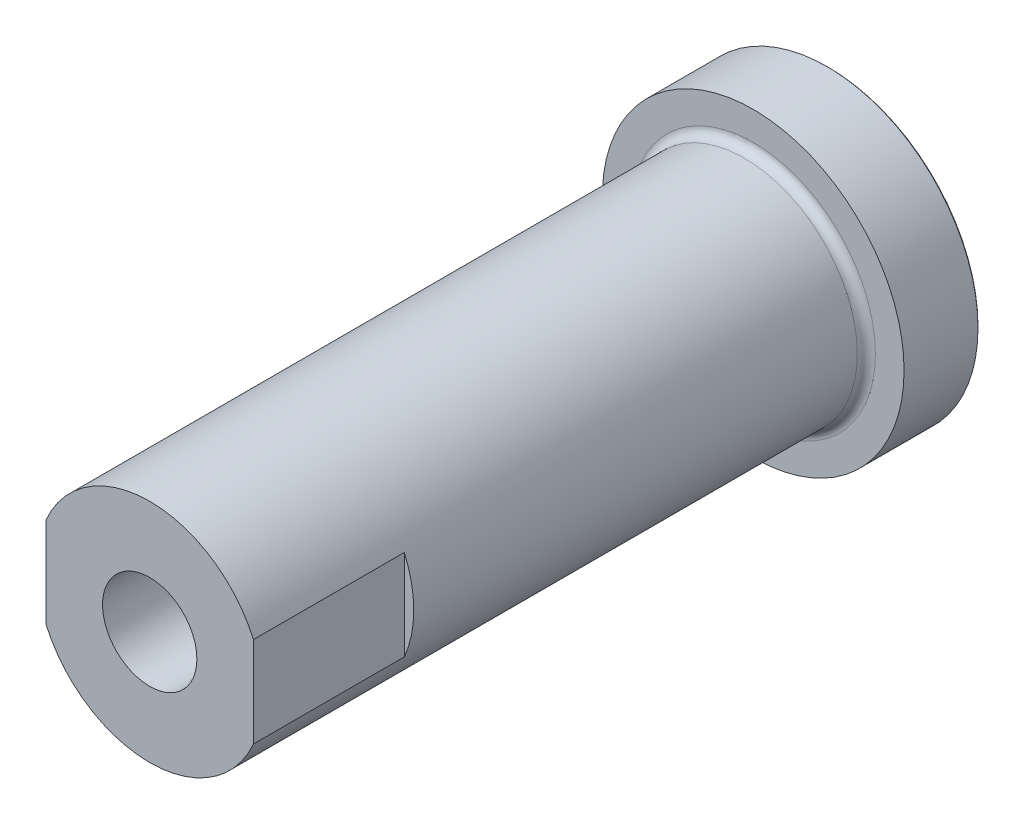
from build123d import *

# Parameters (mm, degrees)
LOGO3_BIB4_W       = 3.96875
LOGO3_BIB4_H       = 12.7
CUT_EXTRUDE2_DEPTH = 19.05


with BuildPart() as part:
    # Logo3_bib1 → Revolve1 (revolve)
    with BuildSketch(Plane(origin=(0, 0, 0), x_dir=(1, 0, 0), z_dir=(0, 1, 0))):
        with BuildLine():
            Line((0, 22.135108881), (0, 57.15))
            Line((0, 57.15), (12.573, 57.15))
            Line((12.573, 57.15), (12.7, 57.023))
            Line((12.7, 57.023), (12.7, 50.8))
            Line((12.7, 50.8), (10.287, 50.8))
            ThreePointArc((10.287, 50.8), (9.748184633, 50.576815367), (9.525, 50.038))
            Line((9.525, 50.038), (9.525, 0))
            Line((9.525, 0), (3.96875, 0))
            Line((3.96875, 0), (3.96875, 19.84375))
            Line((3.96875, 19.84375), (0, 22.135108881))
        make_face()
    revolve(axis=Axis((0, 0, 6.513363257), (0, 0, -1)))

    # Logo3_bib4 → Cut-Extrude2 (cut, symmetric)
    with BuildSketch(Plane(origin=(0, 0, 0), x_dir=(1, 0, 0), z_dir=(0, 1, 0))):
        with Locations((10.715625, 6.35)):
            Rectangle(LOGO3_BIB4_W, LOGO3_BIB4_H)
        with Locations((-10.715625, 6.35)):
            Rectangle(LOGO3_BIB4_W, LOGO3_BIB4_H)
    extrude(amount=CUT_EXTRUDE2_DEPTH, both=True, mode=Mode.SUBTRACT)


solid = part.part
